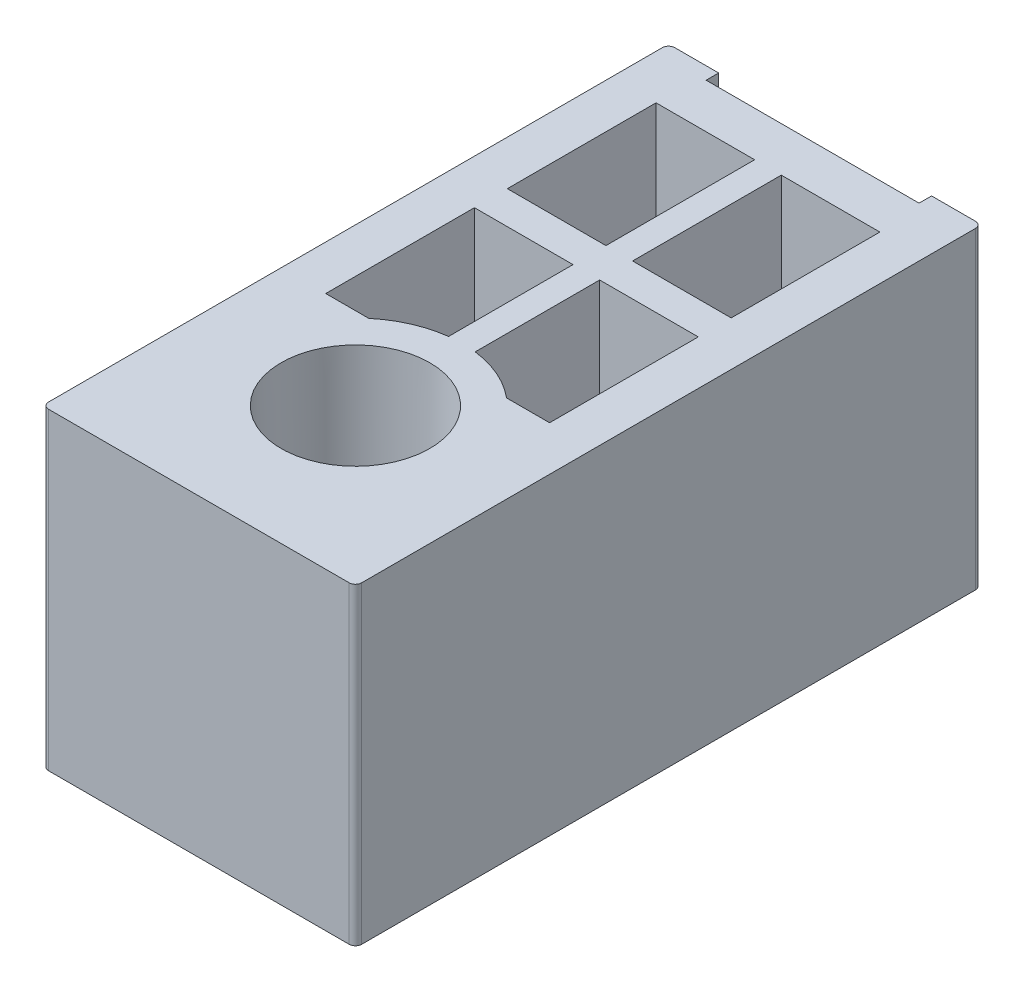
from build123d import *

# Parameters (mm, degrees)
EXTRUSION1_DEPTH                  = 25
ESQUISSE2_R                       = 5.5
ENL_V_MAT_EXTRU_1_DEPTH           = 25
ENL_V_MAT_EXTRU_1_DRAFT           = 1
ESQUISSE2_W                       = 7
ESQUISSE2_H                       = 11
ENL_V_MAT_EXTRU_1_PROFILE_2_DEPTH = 25
ENL_V_MAT_EXTRU_1_PROFILE_2_DRAFT = 1
ENL_V_MAT_EXTRU_1_PROFILE_3_DEPTH = 25
ENL_V_MAT_EXTRU_1_PROFILE_3_DRAFT = 1
ENL_V_MAT_EXTRU_1_PROFILE_4_DEPTH = 25
ENL_V_MAT_EXTRU_1_PROFILE_4_DRAFT = 1
ENL_V_MAT_EXTRU_1_PROFILE_5_DEPTH = 25
ENL_V_MAT_EXTRU_1_PROFILE_5_DRAFT = 1


with BuildPart() as part:
    # Esquisse1 → Extrusion1 (new body)
    with BuildSketch(Plane(origin=(0, 0, 0), x_dir=(1, 0, 0), z_dir=(0, 1, 0))):
        with BuildLine():
            Line((0.5, 0), (24.5, 0))
            ThreePointArc((24.5, 0), (24.853553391, 0.146446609), (25, 0.5))
            Line((25, 0.5), (25, 49.5))
            ThreePointArc((25, 49.5), (24.853553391, 49.853553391), (24.5, 50))
            Line((24.5, 50), (21, 50))
            Line((21, 50), (21, 49))
            Line((21, 49), (4, 49))
            Line((4, 49), (4, 50))
            Line((4, 50), (0.5, 50))
            ThreePointArc((0.5, 50), (0.146446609, 49.853553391), (0, 49.5))
            Line((0, 49.5), (0, 0.5))
            ThreePointArc((0, 0.5), (0.146446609, 0.146446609), (0.5, 0))
        make_face()
    extrude(amount=EXTRUSION1_DEPTH)


with BuildPart() as enl_v_mat_extru_1_tool:
    # Esquisse2 → Enl_v. mat.-Extru.1 (with draft: the straight prism first)
    with BuildSketch(Plane.XZ):
        with Locations((12.5, -12.5)):
            Circle(ESQUISSE2_R)
    extrude(amount=-ENL_V_MAT_EXTRU_1_DEPTH)
    # Enl_v. mat.-Extru.1: the draft: its side faces are tilted about the plane it starts from
    enl_v_mat_extru_1_sides = [enl_v_mat_extru_1_tool.faces().sort_by_distance(p)[0] for p in [
        (7, 12.5, -12.5),
    ]]
    draft(enl_v_mat_extru_1_sides, Plane.XZ, ENL_V_MAT_EXTRU_1_DRAFT)


with BuildPart() as part_1:
    add(part.part)

    # Enl_v. mat.-Extru.1: cut by enl_v_mat_extru_1_tool
    add(enl_v_mat_extru_1_tool.part, mode=Mode.SUBTRACT)


with BuildPart() as enl_v_mat_extru_1_profile_2_tool:
    # Esquisse2 → Enl_v. mat.-Extru.1 profile 2 (with draft: the straight prism first)
    with BuildSketch(Plane.XZ):
        with Locations((7.5, -39.5)):
            Rectangle(ESQUISSE2_W, ESQUISSE2_H)
    extrude(amount=-ENL_V_MAT_EXTRU_1_PROFILE_2_DEPTH)
    # Enl_v. mat.-Extru.1 profile 2: the draft: its side faces are tilted about the plane it starts from
    enl_v_mat_extru_1_profile_2_sides = [enl_v_mat_extru_1_profile_2_tool.faces().sort_by_distance(p)[0] for p in [
        (7.5, 12.5, -45),
        (11, 12.5, -39.5),
        (7.5, 12.5, -34),
        (4, 12.5, -39.5),
    ]]
    draft(enl_v_mat_extru_1_profile_2_sides, Plane.XZ, ENL_V_MAT_EXTRU_1_PROFILE_2_DRAFT)


with BuildPart() as part_2:
    add(part_1.part)

    # Enl_v. mat.-Extru.1 profile 2: cut by enl_v_mat_extru_1_profile_2_tool
    add(enl_v_mat_extru_1_profile_2_tool.part, mode=Mode.SUBTRACT)


with BuildPart() as enl_v_mat_extru_1_profile_3_tool:
    # Esquisse2 → Enl_v. mat.-Extru.1 profile 3 (with draft: the straight prism first)
    with BuildSketch(Plane.XZ):
        with BuildLine():
            Line((4, -30.5), (11, -30.5))
            Line((11, -30.5), (11, -21.374119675))
            ThreePointArc((11, -21.374119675), (8.800916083, -20.70468026), (6.843145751, -19.5))
            Line((6.843145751, -19.5), (4, -19.5))
            Line((4, -19.5), (4, -30.5))
        make_face()
    extrude(amount=-ENL_V_MAT_EXTRU_1_PROFILE_3_DEPTH)
    # Enl_v. mat.-Extru.1 profile 3: the draft: its side faces are tilted about the plane it starts from
    enl_v_mat_extru_1_profile_3_sides = [enl_v_mat_extru_1_profile_3_tool.faces().sort_by_distance(p)[0] for p in [
        (7.5, 12.5, -30.5),
        (11, 12.5, -25.937059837),
        (8.800916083, 12.5, -20.70468026),
        (5.421572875, 12.5, -19.5),
        (4, 12.5, -25),
    ]]
    draft(enl_v_mat_extru_1_profile_3_sides, Plane.XZ, ENL_V_MAT_EXTRU_1_PROFILE_3_DRAFT)


with BuildPart() as part_3:
    add(part_2.part)

    # Enl_v. mat.-Extru.1 profile 3: cut by enl_v_mat_extru_1_profile_3_tool
    add(enl_v_mat_extru_1_profile_3_tool.part, mode=Mode.SUBTRACT)


with BuildPart() as enl_v_mat_extru_1_profile_4_tool:
    # Esquisse2 → Enl_v. mat.-Extru.1 profile 4 (with draft: the straight prism first)
    with BuildSketch(Plane.XZ):
        with BuildLine():
            Line((21, -19.5), (18.156854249, -19.5))
            ThreePointArc((18.156854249, -19.5), (16.199083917, -20.70468026), (14, -21.374119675))
            Line((14, -21.374119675), (14, -30.5))
            Line((14, -30.5), (21, -30.5))
            Line((21, -30.5), (21, -19.5))
        make_face()
    extrude(amount=-ENL_V_MAT_EXTRU_1_PROFILE_4_DEPTH)
    # Enl_v. mat.-Extru.1 profile 4: the draft: its side faces are tilted about the plane it starts from
    enl_v_mat_extru_1_profile_4_sides = [enl_v_mat_extru_1_profile_4_tool.faces().sort_by_distance(p)[0] for p in [
        (19.578427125, 12.5, -19.5),
        (16.199083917, 12.5, -20.70468026),
        (14, 12.5, -25.937059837),
        (17.5, 12.5, -30.5),
        (21, 12.5, -25),
    ]]
    draft(enl_v_mat_extru_1_profile_4_sides, Plane.XZ, ENL_V_MAT_EXTRU_1_PROFILE_4_DRAFT)


with BuildPart() as part_4:
    add(part_3.part)

    # Enl_v. mat.-Extru.1 profile 4: cut by enl_v_mat_extru_1_profile_4_tool
    add(enl_v_mat_extru_1_profile_4_tool.part, mode=Mode.SUBTRACT)


with BuildPart() as enl_v_mat_extru_1_profile_5_tool:
    # Esquisse2 → Enl_v. mat.-Extru.1 profile 5 (with draft: the straight prism first)
    with BuildSketch(Plane.XZ):
        with Locations((17.5, -39.5)):
            Rectangle(ESQUISSE2_W, ESQUISSE2_H)
    extrude(amount=-ENL_V_MAT_EXTRU_1_PROFILE_5_DEPTH)
    # Enl_v. mat.-Extru.1 profile 5: the draft: its side faces are tilted about the plane it starts from
    enl_v_mat_extru_1_profile_5_sides = [enl_v_mat_extru_1_profile_5_tool.faces().sort_by_distance(p)[0] for p in [
        (17.5, 12.5, -45),
        (21, 12.5, -39.5),
        (17.5, 12.5, -34),
        (14, 12.5, -39.5),
    ]]
    draft(enl_v_mat_extru_1_profile_5_sides, Plane.XZ, ENL_V_MAT_EXTRU_1_PROFILE_5_DRAFT)


with BuildPart() as part_5:
    add(part_4.part)

    # Enl_v. mat.-Extru.1 profile 5: cut by enl_v_mat_extru_1_profile_5_tool
    add(enl_v_mat_extru_1_profile_5_tool.part, mode=Mode.SUBTRACT)


solid = part_5.part
